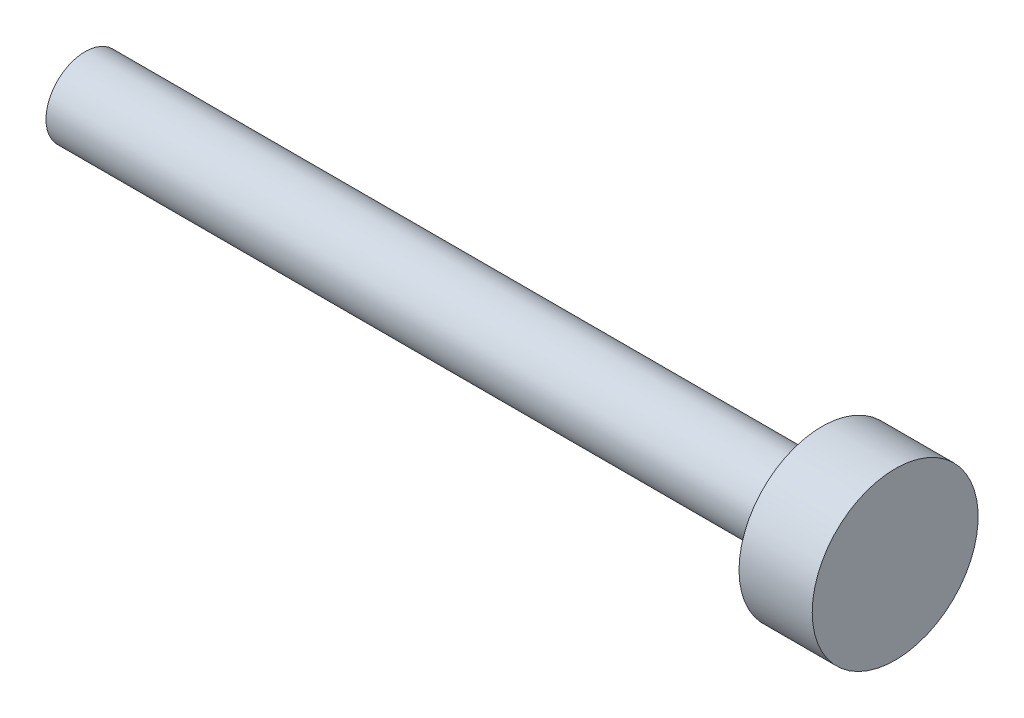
from build123d import *

# Parameters (mm, degrees)
TROU_TARAUD_M10X1_51_D     = 8.5
TROU_TARAUD_M10X1_51_DEPTH = 22.5
TROU_TARAUD_M10X1_51_TIP   = 2.553657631


with BuildPart() as part:
    # Esquisse1 → Base-R_volution (revolve)
    with BuildSketch(Plane.XY, mode=Mode.PRIVATE) as base_r_volution_sk:
        Polygon((43, 0), (43, 8), (194, 8), (194, 17), (209, 17), (209, 0), align=None)
    revolve(base_r_volution_sk.sketch.rotate(Axis((0, 0, 0), (1, 0, 0)), 90), axis=Axis((0, 0, 0), (1, 0, 0)))

    # Trou taraud_ M10x1.51
    with Locations(Plane.ZY.offset(-43)):
        with Locations((0, 0)):
            Hole(TROU_TARAUD_M10X1_51_D / 2, depth=TROU_TARAUD_M10X1_51_DEPTH)
            with Locations((0, 0, -(TROU_TARAUD_M10X1_51_DEPTH + TROU_TARAUD_M10X1_51_TIP / 2))):  # 118° drill point
                Cone(0, TROU_TARAUD_M10X1_51_D / 2, TROU_TARAUD_M10X1_51_TIP, mode=Mode.SUBTRACT)


solid = part.part
